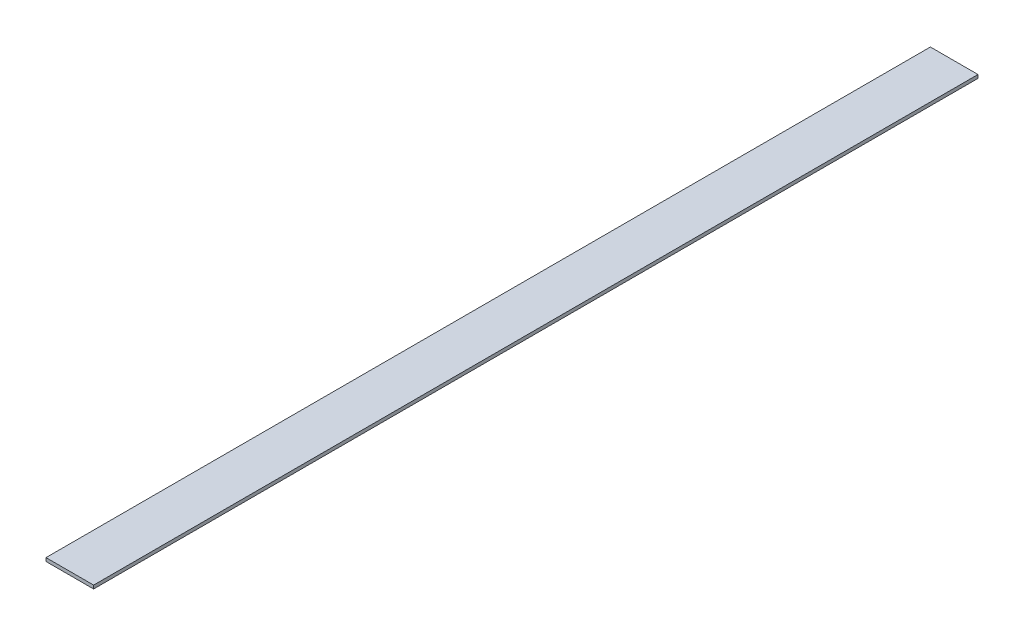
ISO-10303-21;
HEADER;
FILE_DESCRIPTION(('STEP AP214'),'2;1');
FILE_NAME('part.step','',(''),(''),'','','');
FILE_SCHEMA(('AUTOMOTIVE_DESIGN { 1 0 10303 214 1 1 1 1 }'));
ENDSEC;
DATA;
#1=APPLICATION_CONTEXT('core data for automotive mechanical design processes');
#2=APPLICATION_PROTOCOL_DEFINITION('international standard','automotive_design',2000,#1);
#3=PRODUCT_CONTEXT('',#1,'mechanical');
#4=PRODUCT('Part','Part','',(#3));
#5=PRODUCT_RELATED_PRODUCT_CATEGORY('part','',(#4));
#6=PRODUCT_DEFINITION_FORMATION('','',#4);
#7=PRODUCT_DEFINITION_CONTEXT('part definition',#1,'design');
#8=PRODUCT_DEFINITION('design','',#6,#7);
#9=PRODUCT_DEFINITION_SHAPE('','',#8);
#10=(LENGTH_UNIT() NAMED_UNIT(*) SI_UNIT(.MILLI.,.METRE.));
#11=(NAMED_UNIT(*) PLANE_ANGLE_UNIT() SI_UNIT($,.RADIAN.));
#12=(NAMED_UNIT(*) SI_UNIT($,.STERADIAN.) SOLID_ANGLE_UNIT());
#13=UNCERTAINTY_MEASURE_WITH_UNIT(LENGTH_MEASURE(1.E-05),#10,'distance_accuracy_value','');
#14=(GEOMETRIC_REPRESENTATION_CONTEXT(3) GLOBAL_UNCERTAINTY_ASSIGNED_CONTEXT((#13)) GLOBAL_UNIT_ASSIGNED_CONTEXT((#10,
#11,#12)) REPRESENTATION_CONTEXT('',''));
#15=CARTESIAN_POINT('',(0.,0.,0.));
#16=DIRECTION('',(0.,0.,1.));
#17=DIRECTION('',(1.,0.,0.));
#18=AXIS2_PLACEMENT_3D('',#15,#16,#17);
#19=CARTESIAN_POINT('',(0.,0.,-1300.));
#20=DIRECTION('',(-1.,0.,0.));
#21=DIRECTION('',(0.,-1.,0.));
#22=AXIS2_PLACEMENT_3D('',#19,#20,#21);
#23=PLANE('',#22);
#24=DIRECTION('',(0.,-1.,0.));
#25=VECTOR('',#24,1.);
#26=CARTESIAN_POINT('',(0.,0.,0.));
#27=LINE('',#26,#25);
#28=CARTESIAN_POINT('',(0.,0.,0.));
#29=VERTEX_POINT('',#28);
#30=CARTESIAN_POINT('',(0.,-5.,0.));
#31=VERTEX_POINT('',#30);
#32=EDGE_CURVE('E69',#29,#31,#27,.T.);
#33=ORIENTED_EDGE('',*,*,#32,.F.);
#34=DIRECTION('',(0.,0.,1.));
#35=VECTOR('',#34,1.);
#36=CARTESIAN_POINT('',(0.,0.,-1300.));
#37=LINE('',#36,#35);
#38=CARTESIAN_POINT('',(0.,0.,-1300.));
#39=VERTEX_POINT('',#38);
#40=EDGE_CURVE('E11',#39,#29,#37,.T.);
#41=ORIENTED_EDGE('',*,*,#40,.F.);
#42=DIRECTION('',(0.,-1.,0.));
#43=VECTOR('',#42,1.);
#44=CARTESIAN_POINT('',(0.,0.,-1300.));
#45=LINE('',#44,#43);
#46=CARTESIAN_POINT('',(0.,-5.,-1300.));
#47=VERTEX_POINT('',#46);
#48=EDGE_CURVE('E71',#39,#47,#45,.T.);
#49=ORIENTED_EDGE('',*,*,#48,.T.);
#50=DIRECTION('',(0.,0.,1.));
#51=VECTOR('',#50,1.);
#52=CARTESIAN_POINT('',(0.,-5.,-1300.));
#53=LINE('',#52,#51);
#54=EDGE_CURVE('E32',#47,#31,#53,.T.);
#55=ORIENTED_EDGE('',*,*,#54,.T.);
#56=EDGE_LOOP('',(#33,#41,#49,#55));
#57=FACE_BOUND('',#56,.T.);
#58=ADVANCED_FACE('F29',(#57),#23,.T.);
#59=CARTESIAN_POINT('',(0.,0.,-1300.));
#60=DIRECTION('',(0.,1.,0.));
#61=DIRECTION('',(0.,0.,1.));
#62=AXIS2_PLACEMENT_3D('',#59,#60,#61);
#63=PLANE('',#62);
#64=DIRECTION('',(-1.,0.,0.));
#65=VECTOR('',#64,1.);
#66=CARTESIAN_POINT('',(0.,0.,0.));
#67=LINE('',#66,#65);
#68=CARTESIAN_POINT('',(70.,0.,0.));
#69=VERTEX_POINT('',#68);
#70=EDGE_CURVE('E86',#69,#29,#67,.T.);
#71=ORIENTED_EDGE('',*,*,#70,.F.);
#72=DIRECTION('',(0.,0.,1.));
#73=VECTOR('',#72,1.);
#74=CARTESIAN_POINT('',(70.,0.,-1300.));
#75=LINE('',#74,#73);
#76=CARTESIAN_POINT('',(70.,0.,-1300.));
#77=VERTEX_POINT('',#76);
#78=EDGE_CURVE('E37',#77,#69,#75,.T.);
#79=ORIENTED_EDGE('',*,*,#78,.F.);
#80=DIRECTION('',(-1.,0.,0.));
#81=VECTOR('',#80,1.);
#82=CARTESIAN_POINT('',(0.,0.,-1300.));
#83=LINE('',#82,#81);
#84=EDGE_CURVE('E76',#77,#39,#83,.T.);
#85=ORIENTED_EDGE('',*,*,#84,.T.);
#86=ORIENTED_EDGE('',*,*,#40,.T.);
#87=EDGE_LOOP('',(#71,#79,#85,#86));
#88=FACE_BOUND('',#87,.T.);
#89=ADVANCED_FACE('F101',(#88),#63,.T.);
#90=CARTESIAN_POINT('',(70.,0.,-1300.));
#91=DIRECTION('',(1.,0.,0.));
#92=DIRECTION('',(0.,0.,-1.));
#93=AXIS2_PLACEMENT_3D('',#90,#91,#92);
#94=PLANE('',#93);
#95=DIRECTION('',(0.,1.,0.));
#96=VECTOR('',#95,1.);
#97=CARTESIAN_POINT('',(70.,0.,0.));
#98=LINE('',#97,#96);
#99=CARTESIAN_POINT('',(70.,-5.,0.));
#100=VERTEX_POINT('',#99);
#101=EDGE_CURVE('E83',#100,#69,#98,.T.);
#102=ORIENTED_EDGE('',*,*,#101,.F.);
#103=DIRECTION('',(0.,0.,1.));
#104=VECTOR('',#103,1.);
#105=CARTESIAN_POINT('',(70.,-5.,-1300.));
#106=LINE('',#105,#104);
#107=CARTESIAN_POINT('',(70.,-5.,-1300.));
#108=VERTEX_POINT('',#107);
#109=EDGE_CURVE('E75',#108,#100,#106,.T.);
#110=ORIENTED_EDGE('',*,*,#109,.F.);
#111=DIRECTION('',(0.,1.,0.));
#112=VECTOR('',#111,1.);
#113=CARTESIAN_POINT('',(70.,0.,-1300.));
#114=LINE('',#113,#112);
#115=EDGE_CURVE('E94',#108,#77,#114,.T.);
#116=ORIENTED_EDGE('',*,*,#115,.T.);
#117=ORIENTED_EDGE('',*,*,#78,.T.);
#118=EDGE_LOOP('',(#102,#110,#116,#117));
#119=FACE_BOUND('',#118,.T.);
#120=ADVANCED_FACE('F98',(#119),#94,.T.);
#121=CARTESIAN_POINT('',(0.,-5.,-1300.));
#122=DIRECTION('',(0.,-1.,0.));
#123=DIRECTION('',(0.,0.,-1.));
#124=AXIS2_PLACEMENT_3D('',#121,#122,#123);
#125=PLANE('',#124);
#126=DIRECTION('',(1.,0.,0.));
#127=VECTOR('',#126,1.);
#128=CARTESIAN_POINT('',(0.,-5.,0.));
#129=LINE('',#128,#127);
#130=EDGE_CURVE('E78',#31,#100,#129,.T.);
#131=ORIENTED_EDGE('',*,*,#130,.F.);
#132=ORIENTED_EDGE('',*,*,#54,.F.);
#133=DIRECTION('',(1.,0.,0.));
#134=VECTOR('',#133,1.);
#135=CARTESIAN_POINT('',(0.,-5.,-1300.));
#136=LINE('',#135,#134);
#137=EDGE_CURVE('E92',#47,#108,#136,.T.);
#138=ORIENTED_EDGE('',*,*,#137,.T.);
#139=ORIENTED_EDGE('',*,*,#109,.T.);
#140=EDGE_LOOP('',(#131,#132,#138,#139));
#141=FACE_BOUND('',#140,.T.);
#142=ADVANCED_FACE('F79',(#141),#125,.T.);
#143=CARTESIAN_POINT('',(0.,-5.,-1300.));
#144=DIRECTION('',(0.,0.,1.));
#145=DIRECTION('',(1.,0.,0.));
#146=AXIS2_PLACEMENT_3D('',#143,#144,#145);
#147=PLANE('',#146);
#148=ORIENTED_EDGE('',*,*,#48,.F.);
#149=ORIENTED_EDGE('',*,*,#84,.F.);
#150=ORIENTED_EDGE('',*,*,#115,.F.);
#151=ORIENTED_EDGE('',*,*,#137,.F.);
#152=EDGE_LOOP('',(#148,#149,#150,#151));
#153=FACE_BOUND('',#152,.T.);
#154=ADVANCED_FACE('F103',(#153),#147,.F.);
#155=CARTESIAN_POINT('',(0.,-5.,0.));
#156=DIRECTION('',(0.,0.,1.));
#157=DIRECTION('',(1.,0.,0.));
#158=AXIS2_PLACEMENT_3D('',#155,#156,#157);
#159=PLANE('',#158);
#160=ORIENTED_EDGE('',*,*,#32,.T.);
#161=ORIENTED_EDGE('',*,*,#130,.T.);
#162=ORIENTED_EDGE('',*,*,#101,.T.);
#163=ORIENTED_EDGE('',*,*,#70,.T.);
#164=EDGE_LOOP('',(#160,#161,#162,#163));
#165=FACE_BOUND('',#164,.T.);
#166=ADVANCED_FACE('F85',(#165),#159,.T.);
#167=CLOSED_SHELL('',(#58,#89,#120,#142,#154,#166));
#168=MANIFOLD_SOLID_BREP('B2',#167);
#169=ADVANCED_BREP_SHAPE_REPRESENTATION('',(#18,#168),#14);
#170=SHAPE_DEFINITION_REPRESENTATION(#9,#169);
ENDSEC;
END-ISO-10303-21;
